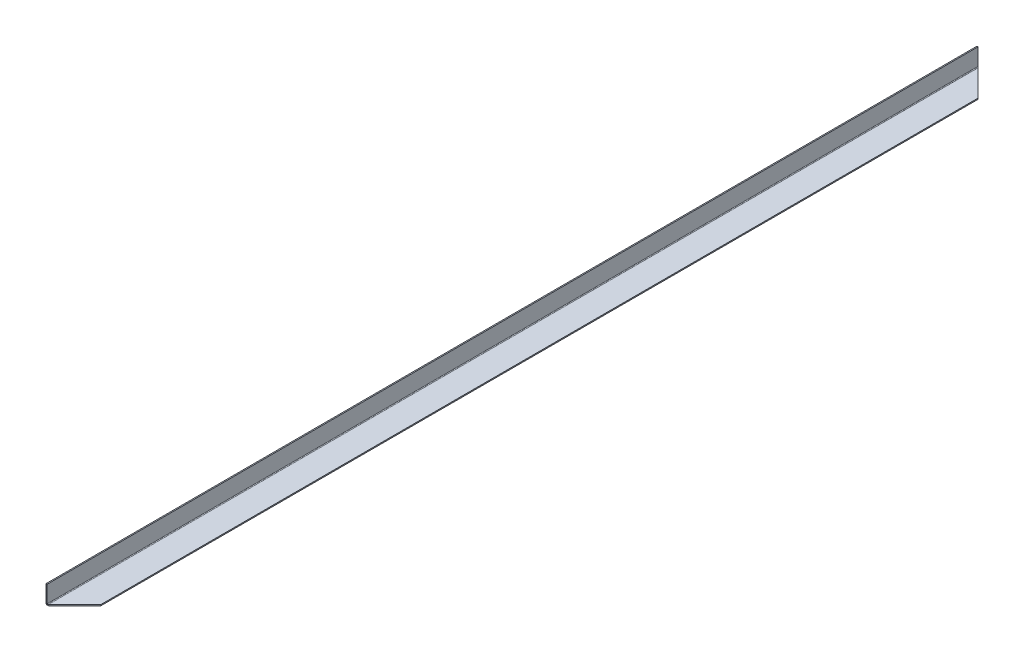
ISO-10303-21;
HEADER;
FILE_DESCRIPTION(('STEP AP214'),'2;1');
FILE_NAME('part.step','',(''),(''),'','','');
FILE_SCHEMA(('AUTOMOTIVE_DESIGN { 1 0 10303 214 1 1 1 1 }'));
ENDSEC;
DATA;
#1=APPLICATION_CONTEXT('core data for automotive mechanical design processes');
#2=APPLICATION_PROTOCOL_DEFINITION('international standard','automotive_design',2000,#1);
#3=PRODUCT_CONTEXT('',#1,'mechanical');
#4=PRODUCT('Part','Part','',(#3));
#5=PRODUCT_RELATED_PRODUCT_CATEGORY('part','',(#4));
#6=PRODUCT_DEFINITION_FORMATION('','',#4);
#7=PRODUCT_DEFINITION_CONTEXT('part definition',#1,'design');
#8=PRODUCT_DEFINITION('design','',#6,#7);
#9=PRODUCT_DEFINITION_SHAPE('','',#8);
#10=(LENGTH_UNIT() NAMED_UNIT(*) SI_UNIT(.MILLI.,.METRE.));
#11=(NAMED_UNIT(*) PLANE_ANGLE_UNIT() SI_UNIT($,.RADIAN.));
#12=(NAMED_UNIT(*) SI_UNIT($,.STERADIAN.) SOLID_ANGLE_UNIT());
#13=UNCERTAINTY_MEASURE_WITH_UNIT(LENGTH_MEASURE(1.E-05),#10,'distance_accuracy_value','');
#14=(GEOMETRIC_REPRESENTATION_CONTEXT(3) GLOBAL_UNCERTAINTY_ASSIGNED_CONTEXT((#13)) GLOBAL_UNIT_ASSIGNED_CONTEXT((#10,
#11,#12)) REPRESENTATION_CONTEXT('',''));
#15=CARTESIAN_POINT('',(0.,0.,0.));
#16=DIRECTION('',(0.,0.,1.));
#17=DIRECTION('',(1.,0.,0.));
#18=AXIS2_PLACEMENT_3D('',#15,#16,#17);
#19=CARTESIAN_POINT('',(0.,0.,1000.));
#20=DIRECTION('',(0.,1.,0.));
#21=DIRECTION('',(0.,0.,1.));
#22=AXIS2_PLACEMENT_3D('',#19,#20,#21);
#23=PLANE('',#22);
#24=DIRECTION('',(0.707106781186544,0.,0.707106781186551));
#25=VECTOR('',#24,1.);
#26=CARTESIAN_POINT('',(500.,0.,500.000000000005));
#27=LINE('',#26,#25);
#28=CARTESIAN_POINT('',(1.9366,0.,1.93659999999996));
#29=VERTEX_POINT('',#28);
#30=CARTESIAN_POINT('',(30.,0.,30.0000000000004));
#31=VERTEX_POINT('',#30);
#32=EDGE_CURVE('E166',#29,#31,#27,.T.);
#33=ORIENTED_EDGE('',*,*,#32,.T.);
#34=DIRECTION('',(0.,0.,-1.));
#35=VECTOR('',#34,1.);
#36=CARTESIAN_POINT('',(30.,0.,1000.));
#37=LINE('',#36,#35);
#38=CARTESIAN_POINT('',(30.,0.,970.));
#39=VERTEX_POINT('',#38);
#40=EDGE_CURVE('E11',#39,#31,#37,.T.);
#41=ORIENTED_EDGE('',*,*,#40,.F.);
#42=DIRECTION('',(-0.707106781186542,0.,0.707106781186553));
#43=VECTOR('',#42,1.);
#44=CARTESIAN_POINT('',(0.,0.,1000.));
#45=LINE('',#44,#43);
#46=CARTESIAN_POINT('',(1.9366,0.,998.0634));
#47=VERTEX_POINT('',#46);
#48=EDGE_CURVE('E179',#39,#47,#45,.T.);
#49=ORIENTED_EDGE('',*,*,#48,.T.);
#50=DIRECTION('',(0.,0.,-1.));
#51=VECTOR('',#50,1.);
#52=CARTESIAN_POINT('',(1.9366,0.,1000.));
#53=LINE('',#52,#51);
#54=EDGE_CURVE('E130',#47,#29,#53,.T.);
#55=ORIENTED_EDGE('',*,*,#54,.T.);
#56=EDGE_LOOP('',(#33,#41,#49,#55));
#57=FACE_BOUND('',#56,.T.);
#58=ADVANCED_FACE('F34',(#57),#23,.F.);
#59=CARTESIAN_POINT('',(30.,1.2,1000.));
#60=DIRECTION('',(1.,0.,0.));
#61=DIRECTION('',(0.,0.,-1.));
#62=AXIS2_PLACEMENT_3D('',#59,#60,#61);
#63=PLANE('',#62);
#64=ORIENTED_EDGE('',*,*,#40,.T.);
#65=DIRECTION('',(0.,1.,0.));
#66=VECTOR('',#65,1.);
#67=CARTESIAN_POINT('',(30.,1.2,30.0000000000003));
#68=LINE('',#67,#66);
#69=CARTESIAN_POINT('',(30.,1.2,30.0000000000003));
#70=VERTEX_POINT('',#69);
#71=EDGE_CURVE('E160',#70,#31,#68,.F.);
#72=ORIENTED_EDGE('',*,*,#71,.F.);
#73=DIRECTION('',(0.,0.,-1.));
#74=VECTOR('',#73,1.);
#75=CARTESIAN_POINT('',(30.,1.2,1000.));
#76=LINE('',#75,#74);
#77=CARTESIAN_POINT('',(30.,1.2,970.));
#78=VERTEX_POINT('',#77);
#79=EDGE_CURVE('E41',#78,#70,#76,.T.);
#80=ORIENTED_EDGE('',*,*,#79,.F.);
#81=DIRECTION('',(0.,1.,0.));
#82=VECTOR('',#81,1.);
#83=CARTESIAN_POINT('',(30.,1.2,970.));
#84=LINE('',#83,#82);
#85=EDGE_CURVE('E158',#78,#39,#84,.F.);
#86=ORIENTED_EDGE('',*,*,#85,.T.);
#87=EDGE_LOOP('',(#64,#72,#80,#86));
#88=FACE_BOUND('',#87,.T.);
#89=ADVANCED_FACE('F157',(#88),#63,.T.);
#90=CARTESIAN_POINT('',(0.,1.2,1000.));
#91=DIRECTION('',(0.,1.,0.));
#92=DIRECTION('',(0.,0.,1.));
#93=AXIS2_PLACEMENT_3D('',#90,#91,#92);
#94=PLANE('',#93);
#95=ORIENTED_EDGE('',*,*,#79,.T.);
#96=DIRECTION('',(0.707106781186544,0.,0.707106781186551));
#97=VECTOR('',#96,1.);
#98=CARTESIAN_POINT('',(500.,1.2,500.000000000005));
#99=LINE('',#98,#97);
#100=CARTESIAN_POINT('',(1.9366,1.2,1.93659999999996));
#101=VERTEX_POINT('',#100);
#102=EDGE_CURVE('E115',#101,#70,#99,.T.);
#103=ORIENTED_EDGE('',*,*,#102,.F.);
#104=DIRECTION('',(0.,0.,-1.));
#105=VECTOR('',#104,1.);
#106=CARTESIAN_POINT('',(1.9366,1.2,1000.));
#107=LINE('',#106,#105);
#108=CARTESIAN_POINT('',(1.9366,1.2,998.0634));
#109=VERTEX_POINT('',#108);
#110=EDGE_CURVE('E143',#109,#101,#107,.T.);
#111=ORIENTED_EDGE('',*,*,#110,.F.);
#112=DIRECTION('',(-0.707106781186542,0.,0.707106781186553));
#113=VECTOR('',#112,1.);
#114=CARTESIAN_POINT('',(0.,1.2,1000.));
#115=LINE('',#114,#113);
#116=EDGE_CURVE('E153',#78,#109,#115,.T.);
#117=ORIENTED_EDGE('',*,*,#116,.F.);
#118=EDGE_LOOP('',(#95,#103,#111,#117));
#119=FACE_BOUND('',#118,.T.);
#120=ADVANCED_FACE('F150',(#119),#94,.T.);
#121=CARTESIAN_POINT('',(1.9366,1.9366,1000.));
#122=DIRECTION('',(0.,0.,-1.));
#123=DIRECTION('',(-1.,0.,0.));
#124=AXIS2_PLACEMENT_3D('',#121,#122,#123);
#125=CYLINDRICAL_SURFACE('',#124,0.7366);
#126=ORIENTED_EDGE('',*,*,#110,.T.);
#127=CARTESIAN_POINT('',(1.9366,1.9366,1.93659999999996));
#128=DIRECTION('',(-0.707106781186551,0.,0.707106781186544));
#129=DIRECTION('',(-0.707106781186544,0.,-0.707106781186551));
#130=AXIS2_PLACEMENT_3D('',#127,#128,#129);
#131=ELLIPSE('',#130,1.04170971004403,0.7366);
#132=CARTESIAN_POINT('',(1.2,1.9366,1.19999999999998));
#133=VERTEX_POINT('',#132);
#134=EDGE_CURVE('E107',#133,#101,#131,.T.);
#135=ORIENTED_EDGE('',*,*,#134,.F.);
#136=DIRECTION('',(0.,0.,-1.));
#137=VECTOR('',#136,1.);
#138=CARTESIAN_POINT('',(1.2,1.9366,1000.));
#139=LINE('',#138,#137);
#140=CARTESIAN_POINT('',(1.2,1.9366,998.8));
#141=VERTEX_POINT('',#140);
#142=EDGE_CURVE('E140',#141,#133,#139,.T.);
#143=ORIENTED_EDGE('',*,*,#142,.F.);
#144=CARTESIAN_POINT('',(1.9366,1.9366,998.0634));
#145=DIRECTION('',(-0.707106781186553,0.,-0.707106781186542));
#146=DIRECTION('',(0.707106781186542,0.,-0.707106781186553));
#147=AXIS2_PLACEMENT_3D('',#144,#145,#146);
#148=ELLIPSE('',#147,1.04170971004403,0.7366);
#149=EDGE_CURVE('E163',#109,#141,#148,.T.);
#150=ORIENTED_EDGE('',*,*,#149,.F.);
#151=EDGE_LOOP('',(#126,#135,#143,#150));
#152=FACE_BOUND('',#151,.T.);
#153=ADVANCED_FACE('F211',(#152),#125,.F.);
#154=CARTESIAN_POINT('',(1.2,20.,1000.));
#155=DIRECTION('',(1.,0.,0.));
#156=DIRECTION('',(0.,1.,0.));
#157=AXIS2_PLACEMENT_3D('',#154,#155,#156);
#158=PLANE('',#157);
#159=ORIENTED_EDGE('',*,*,#142,.T.);
#160=DIRECTION('',(0.,-1.,0.));
#161=VECTOR('',#160,1.);
#162=CARTESIAN_POINT('',(1.2,20.,1.19999999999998));
#163=LINE('',#162,#161);
#164=CARTESIAN_POINT('',(1.20000000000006,20.,1.20000000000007));
#165=VERTEX_POINT('',#164);
#166=EDGE_CURVE('E106',#165,#133,#163,.T.);
#167=ORIENTED_EDGE('',*,*,#166,.F.);
#168=DIRECTION('',(0.,0.,-1.));
#169=VECTOR('',#168,1.);
#170=CARTESIAN_POINT('',(1.2,20.,1000.));
#171=LINE('',#170,#169);
#172=CARTESIAN_POINT('',(1.19999999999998,20.,998.8));
#173=VERTEX_POINT('',#172);
#174=EDGE_CURVE('E132',#173,#165,#171,.T.);
#175=ORIENTED_EDGE('',*,*,#174,.F.);
#176=DIRECTION('',(0.,1.,0.));
#177=VECTOR('',#176,1.);
#178=CARTESIAN_POINT('',(1.2,20.,998.8));
#179=LINE('',#178,#177);
#180=EDGE_CURVE('E171',#141,#173,#179,.T.);
#181=ORIENTED_EDGE('',*,*,#180,.F.);
#182=EDGE_LOOP('',(#159,#167,#175,#181));
#183=FACE_BOUND('',#182,.T.);
#184=ADVANCED_FACE('F216',(#183),#158,.T.);
#185=CARTESIAN_POINT('',(0.,20.,1000.));
#186=DIRECTION('',(0.,1.,0.));
#187=DIRECTION('',(0.,0.,1.));
#188=AXIS2_PLACEMENT_3D('',#185,#186,#187);
#189=PLANE('',#188);
#190=ORIENTED_EDGE('',*,*,#174,.T.);
#191=DIRECTION('',(1.,0.,0.));
#192=VECTOR('',#191,1.);
#193=CARTESIAN_POINT('',(1.20000000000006,20.,1.20000000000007));
#194=LINE('',#193,#192);
#195=CARTESIAN_POINT('',(0.,20.,1.20000000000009));
#196=VERTEX_POINT('',#195);
#197=EDGE_CURVE('E116',#165,#196,#194,.F.);
#198=ORIENTED_EDGE('',*,*,#197,.T.);
#199=DIRECTION('',(0.,0.,-1.));
#200=VECTOR('',#199,1.);
#201=CARTESIAN_POINT('',(0.,20.,1000.));
#202=LINE('',#201,#200);
#203=CARTESIAN_POINT('',(0.,20.,998.8));
#204=VERTEX_POINT('',#203);
#205=EDGE_CURVE('E125',#204,#196,#202,.T.);
#206=ORIENTED_EDGE('',*,*,#205,.F.);
#207=DIRECTION('',(1.,0.,0.));
#208=VECTOR('',#207,1.);
#209=CARTESIAN_POINT('',(1.19999999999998,20.,998.8));
#210=LINE('',#209,#208);
#211=EDGE_CURVE('E176',#173,#204,#210,.F.);
#212=ORIENTED_EDGE('',*,*,#211,.F.);
#213=EDGE_LOOP('',(#190,#198,#206,#212));
#214=FACE_BOUND('',#213,.T.);
#215=ADVANCED_FACE('F219',(#214),#189,.T.);
#216=CARTESIAN_POINT('',(0.,20.,1000.));
#217=DIRECTION('',(1.,0.,0.));
#218=DIRECTION('',(0.,1.,0.));
#219=AXIS2_PLACEMENT_3D('',#216,#217,#218);
#220=PLANE('',#219);
#221=DIRECTION('',(0.,1.,0.));
#222=VECTOR('',#221,1.);
#223=CARTESIAN_POINT('',(0.,20.,1.20000000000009));
#224=LINE('',#223,#222);
#225=CARTESIAN_POINT('',(0.,1.9366,1.19999999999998));
#226=VERTEX_POINT('',#225);
#227=EDGE_CURVE('E112',#196,#226,#224,.F.);
#228=ORIENTED_EDGE('',*,*,#227,.T.);
#229=DIRECTION('',(0.,0.,-1.));
#230=VECTOR('',#229,1.);
#231=CARTESIAN_POINT('',(0.,1.9366,1000.));
#232=LINE('',#231,#230);
#233=CARTESIAN_POINT('',(0.,1.9366,998.8));
#234=VERTEX_POINT('',#233);
#235=EDGE_CURVE('E123',#234,#226,#232,.T.);
#236=ORIENTED_EDGE('',*,*,#235,.F.);
#237=DIRECTION('',(0.,1.,0.));
#238=VECTOR('',#237,1.);
#239=CARTESIAN_POINT('',(0.,20.,998.8));
#240=LINE('',#239,#238);
#241=EDGE_CURVE('E173',#234,#204,#240,.T.);
#242=ORIENTED_EDGE('',*,*,#241,.T.);
#243=ORIENTED_EDGE('',*,*,#205,.T.);
#244=EDGE_LOOP('',(#228,#236,#242,#243));
#245=FACE_BOUND('',#244,.T.);
#246=ADVANCED_FACE('F121',(#245),#220,.F.);
#247=CARTESIAN_POINT('',(1.9366,1.9366,1000.));
#248=DIRECTION('',(0.,0.,-1.));
#249=DIRECTION('',(-1.,0.,0.));
#250=AXIS2_PLACEMENT_3D('',#247,#248,#249);
#251=CYLINDRICAL_SURFACE('',#250,1.9366);
#252=CARTESIAN_POINT('',(1.9366,1.9366,1.93659999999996));
#253=DIRECTION('',(-0.355509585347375,0.,0.934672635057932));
#254=DIRECTION('',(-0.934672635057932,0.,-0.355509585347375));
#255=AXIS2_PLACEMENT_3D('',#252,#253,#254);
#256=ELLIPSE('',#255,2.07195538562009,1.9366);
#257=EDGE_CURVE('E97',#226,#29,#256,.T.);
#258=ORIENTED_EDGE('',*,*,#257,.T.);
#259=ORIENTED_EDGE('',*,*,#54,.F.);
#260=CARTESIAN_POINT('',(1.9366,1.9366,998.0634));
#261=DIRECTION('',(-0.355509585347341,0.,-0.934672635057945));
#262=DIRECTION('',(0.934672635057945,0.,-0.355509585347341));
#263=AXIS2_PLACEMENT_3D('',#260,#261,#262);
#264=ELLIPSE('',#263,2.07195538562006,1.9366);
#265=EDGE_CURVE('E129',#47,#234,#264,.T.);
#266=ORIENTED_EDGE('',*,*,#265,.T.);
#267=ORIENTED_EDGE('',*,*,#235,.T.);
#268=EDGE_LOOP('',(#258,#259,#266,#267));
#269=FACE_BOUND('',#268,.T.);
#270=ADVANCED_FACE('F128',(#269),#251,.T.);
#271=CARTESIAN_POINT('',(0.,1.2,1000.));
#272=DIRECTION('',(-0.707106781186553,0.,-0.707106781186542));
#273=DIRECTION('',(-0.707106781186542,0.,0.707106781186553));
#274=AXIS2_PLACEMENT_3D('',#271,#272,#273);
#275=PLANE('',#274);
#276=ORIENTED_EDGE('',*,*,#116,.T.);
#277=DIRECTION('',(0.,1.,0.));
#278=VECTOR('',#277,1.);
#279=CARTESIAN_POINT('',(1.9366,1.2,998.0634));
#280=LINE('',#279,#278);
#281=EDGE_CURVE('E134',#109,#47,#280,.F.);
#282=ORIENTED_EDGE('',*,*,#281,.T.);
#283=ORIENTED_EDGE('',*,*,#48,.F.);
#284=ORIENTED_EDGE('',*,*,#85,.F.);
#285=EDGE_LOOP('',(#276,#282,#283,#284));
#286=FACE_BOUND('',#285,.T.);
#287=ADVANCED_FACE('F185',(#286),#275,.F.);
#288=CARTESIAN_POINT('',(1.2,20.,998.8));
#289=DIRECTION('',(0.,0.,-1.));
#290=DIRECTION('',(0.,1.,0.));
#291=AXIS2_PLACEMENT_3D('',#288,#289,#290);
#292=PLANE('',#291);
#293=ORIENTED_EDGE('',*,*,#180,.T.);
#294=ORIENTED_EDGE('',*,*,#211,.T.);
#295=ORIENTED_EDGE('',*,*,#241,.F.);
#296=DIRECTION('',(1.,0.,0.));
#297=VECTOR('',#296,1.);
#298=CARTESIAN_POINT('',(1.2,1.9366,998.8));
#299=LINE('',#298,#297);
#300=EDGE_CURVE('E56',#141,#234,#299,.F.);
#301=ORIENTED_EDGE('',*,*,#300,.F.);
#302=EDGE_LOOP('',(#293,#294,#295,#301));
#303=FACE_BOUND('',#302,.T.);
#304=ADVANCED_FACE('F202',(#303),#292,.F.);
#305=CARTESIAN_POINT('',(2.6732,1.9366,997.3268));
#306=CARTESIAN_POINT('',(3.0732,1.9366,997.3268));
#307=CARTESIAN_POINT('',(3.4732,1.9366,997.3268));
#308=CARTESIAN_POINT('',(3.8732,1.9366,997.3268));
#309=CARTESIAN_POINT('',(2.6732,0.463400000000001,997.3268));
#310=CARTESIAN_POINT('',(3.0732,-0.336599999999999,997.3268));
#311=CARTESIAN_POINT('',(3.4732,-1.1366,997.3268));
#312=CARTESIAN_POINT('',(3.8732,-1.9366,997.3268));
#313=CARTESIAN_POINT('',(1.2,0.463400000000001,998.8));
#314=CARTESIAN_POINT('',(0.800000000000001,-0.336599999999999,998.8));
#315=CARTESIAN_POINT('',(0.400000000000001,-1.1366,998.8));
#316=CARTESIAN_POINT('',(0.,-1.9366,998.8));
#317=CARTESIAN_POINT('',(1.2,1.9366,998.8));
#318=CARTESIAN_POINT('',(0.8,1.9366,998.8));
#319=CARTESIAN_POINT('',(0.4,1.9366,998.8));
#320=CARTESIAN_POINT('',(0.,1.9366,998.8));
#321=CARTESIAN_POINT('',(1.2,3.4098,998.8));
#322=CARTESIAN_POINT('',(0.8,4.2098,998.8));
#323=CARTESIAN_POINT('',(0.4,5.0098,998.8));
#324=CARTESIAN_POINT('',(0.,5.8098,998.8));
#325=CARTESIAN_POINT('',(2.6732,3.4098,997.3268));
#326=CARTESIAN_POINT('',(3.0732,4.2098,997.3268));
#327=CARTESIAN_POINT('',(3.4732,5.0098,997.3268));
#328=CARTESIAN_POINT('',(3.8732,5.8098,997.3268));
#329=CARTESIAN_POINT('',(2.6732,1.9366,997.3268));
#330=CARTESIAN_POINT('',(3.0732,1.9366,997.3268));
#331=CARTESIAN_POINT('',(3.4732,1.9366,997.3268));
#332=CARTESIAN_POINT('',(3.8732,1.9366,997.3268));
#333=(BOUNDED_SURFACE() B_SPLINE_SURFACE(3,3,((#305,#306,#307,#308),(#309,#310,#311,#312),(#313,
#314,#315,#316),(#317,#318,#319,#320),(#321,#322,#323,#324),(#325,#326,#327,#328),(#329,#330,
#331,#332)),.UNSPECIFIED.,.T.,.F.,.F.) B_SPLINE_SURFACE_WITH_KNOTS((4,3,4),(4,4),(0.,0.5,1.),
(0.,1.),.UNSPECIFIED.) GEOMETRIC_REPRESENTATION_ITEM() RATIONAL_B_SPLINE_SURFACE(((1.,1.,1.,1.),
(0.333333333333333,0.333333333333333,0.333333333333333,0.333333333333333),(0.333333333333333,
0.333333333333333,0.333333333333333,0.333333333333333),(1.,1.,1.,1.),(0.333333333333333,
0.333333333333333,0.333333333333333,0.333333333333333),(0.333333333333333,0.333333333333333,
0.333333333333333,0.333333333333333),(1.,1.,1.,1.))) REPRESENTATION_ITEM('') SURFACE());
#334=ORIENTED_EDGE('',*,*,#149,.T.);
#335=ORIENTED_EDGE('',*,*,#300,.T.);
#336=ORIENTED_EDGE('',*,*,#265,.F.);
#337=ORIENTED_EDGE('',*,*,#281,.F.);
#338=EDGE_LOOP('',(#334,#335,#336,#337));
#339=FACE_BOUND('',#338,.T.);
#340=ADVANCED_FACE('F195',(#339),#333,.T.);
#341=CARTESIAN_POINT('',(500.,1.2,500.000000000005));
#342=DIRECTION('',(-0.707106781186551,0.,0.707106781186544));
#343=DIRECTION('',(0.707106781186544,0.,0.707106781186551));
#344=AXIS2_PLACEMENT_3D('',#341,#342,#343);
#345=PLANE('',#344);
#346=ORIENTED_EDGE('',*,*,#102,.T.);
#347=ORIENTED_EDGE('',*,*,#71,.T.);
#348=ORIENTED_EDGE('',*,*,#32,.F.);
#349=DIRECTION('',(0.,1.,0.));
#350=VECTOR('',#349,1.);
#351=CARTESIAN_POINT('',(1.9366,1.2,1.93659999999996));
#352=LINE('',#351,#350);
#353=EDGE_CURVE('E48',#101,#29,#352,.F.);
#354=ORIENTED_EDGE('',*,*,#353,.F.);
#355=EDGE_LOOP('',(#346,#347,#348,#354));
#356=FACE_BOUND('',#355,.T.);
#357=ADVANCED_FACE('F193',(#356),#345,.F.);
#358=CARTESIAN_POINT('',(1.2,20.,1.19999999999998));
#359=DIRECTION('',(0.,0.,1.));
#360=DIRECTION('',(0.,-1.,0.));
#361=AXIS2_PLACEMENT_3D('',#358,#359,#360);
#362=PLANE('',#361);
#363=ORIENTED_EDGE('',*,*,#166,.T.);
#364=DIRECTION('',(1.,0.,0.));
#365=VECTOR('',#364,1.);
#366=CARTESIAN_POINT('',(1.2,1.9366,1.19999999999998));
#367=LINE('',#366,#365);
#368=EDGE_CURVE('E100',#133,#226,#367,.F.);
#369=ORIENTED_EDGE('',*,*,#368,.T.);
#370=ORIENTED_EDGE('',*,*,#227,.F.);
#371=ORIENTED_EDGE('',*,*,#197,.F.);
#372=EDGE_LOOP('',(#363,#369,#370,#371));
#373=FACE_BOUND('',#372,.T.);
#374=ADVANCED_FACE('F111',(#373),#362,.F.);
#375=CARTESIAN_POINT('',(1.2,1.9366,1.19999999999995));
#376=CARTESIAN_POINT('',(0.8,1.9366,1.19999999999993));
#377=CARTESIAN_POINT('',(0.4,1.9366,1.19999999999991));
#378=CARTESIAN_POINT('',(0.,1.9366,1.1999999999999));
#379=CARTESIAN_POINT('',(1.2,0.4634,1.19999999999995));
#380=CARTESIAN_POINT('',(0.8,-0.3366,1.19999999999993));
#381=CARTESIAN_POINT('',(0.4,-1.1366,1.19999999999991));
#382=CARTESIAN_POINT('',(0.,-1.9366,1.1999999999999));
#383=CARTESIAN_POINT('',(2.6732,0.4634,2.67319999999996));
#384=CARTESIAN_POINT('',(3.0732,-0.3366,2.67319999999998));
#385=CARTESIAN_POINT('',(3.4732,-1.1366,2.6732));
#386=CARTESIAN_POINT('',(3.8732,-1.9366,2.67320000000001));
#387=CARTESIAN_POINT('',(2.6732,1.9366,2.67319999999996));
#388=CARTESIAN_POINT('',(3.0732,1.9366,2.67319999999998));
#389=CARTESIAN_POINT('',(3.4732,1.9366,2.6732));
#390=CARTESIAN_POINT('',(3.8732,1.9366,2.67320000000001));
#391=CARTESIAN_POINT('',(2.6732,3.4098,2.67319999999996));
#392=CARTESIAN_POINT('',(3.0732,4.2098,2.67319999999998));
#393=CARTESIAN_POINT('',(3.4732,5.0098,2.6732));
#394=CARTESIAN_POINT('',(3.8732,5.8098,2.67320000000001));
#395=CARTESIAN_POINT('',(1.2,3.4098,1.19999999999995));
#396=CARTESIAN_POINT('',(0.8,4.2098,1.19999999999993));
#397=CARTESIAN_POINT('',(0.4,5.0098,1.19999999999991));
#398=CARTESIAN_POINT('',(0.,5.8098,1.1999999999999));
#399=CARTESIAN_POINT('',(1.2,1.9366,1.19999999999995));
#400=CARTESIAN_POINT('',(0.8,1.9366,1.19999999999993));
#401=CARTESIAN_POINT('',(0.4,1.9366,1.19999999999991));
#402=CARTESIAN_POINT('',(0.,1.9366,1.1999999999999));
#403=(BOUNDED_SURFACE() B_SPLINE_SURFACE(3,3,((#375,#376,#377,#378),(#379,#380,#381,#382),(#383,
#384,#385,#386),(#387,#388,#389,#390),(#391,#392,#393,#394),(#395,#396,#397,#398),(#399,#400,
#401,#402)),.UNSPECIFIED.,.T.,.F.,.F.) B_SPLINE_SURFACE_WITH_KNOTS((4,3,4),(4,4),(0.,0.5,1.),
(0.,1.),.UNSPECIFIED.) GEOMETRIC_REPRESENTATION_ITEM() RATIONAL_B_SPLINE_SURFACE(((1.,1.,1.,1.),
(0.333333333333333,0.333333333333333,0.333333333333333,0.333333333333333),(0.333333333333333,
0.333333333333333,0.333333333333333,0.333333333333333),(1.,1.,1.,1.),(0.333333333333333,
0.333333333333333,0.333333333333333,0.333333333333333),(0.333333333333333,0.333333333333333,
0.333333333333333,0.333333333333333),(1.,1.,1.,1.))) REPRESENTATION_ITEM('') SURFACE());
#404=ORIENTED_EDGE('',*,*,#134,.T.);
#405=ORIENTED_EDGE('',*,*,#353,.T.);
#406=ORIENTED_EDGE('',*,*,#257,.F.);
#407=ORIENTED_EDGE('',*,*,#368,.F.);
#408=EDGE_LOOP('',(#404,#405,#406,#407));
#409=FACE_BOUND('',#408,.T.);
#410=ADVANCED_FACE('F99',(#409),#403,.T.);
#411=CLOSED_SHELL('',(#58,#89,#120,#153,#184,#215,#246,#270,#287,#304,#340,#357,#374,#410));
#412=MANIFOLD_SOLID_BREP('B2',#411);
#413=ADVANCED_BREP_SHAPE_REPRESENTATION('',(#18,#412),#14);
#414=SHAPE_DEFINITION_REPRESENTATION(#9,#413);
ENDSEC;
END-ISO-10303-21;
